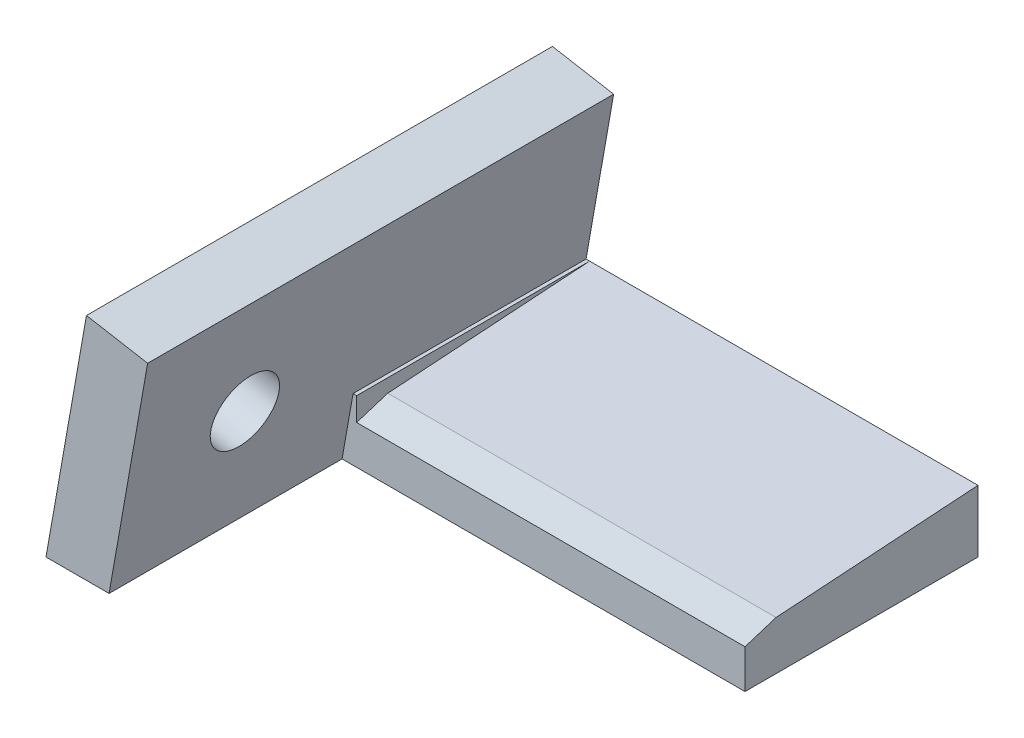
ISO-10303-21;
HEADER;
FILE_DESCRIPTION(('STEP AP214'),'2;1');
FILE_NAME('part.step','',(''),(''),'','','');
FILE_SCHEMA(('AUTOMOTIVE_DESIGN { 1 0 10303 214 1 1 1 1 }'));
ENDSEC;
DATA;
#1=APPLICATION_CONTEXT('core data for automotive mechanical design processes');
#2=APPLICATION_PROTOCOL_DEFINITION('international standard','automotive_design',2000,#1);
#3=PRODUCT_CONTEXT('',#1,'mechanical');
#4=PRODUCT('Part','Part','',(#3));
#5=PRODUCT_RELATED_PRODUCT_CATEGORY('part','',(#4));
#6=PRODUCT_DEFINITION_FORMATION('','',#4);
#7=PRODUCT_DEFINITION_CONTEXT('part definition',#1,'design');
#8=PRODUCT_DEFINITION('design','',#6,#7);
#9=PRODUCT_DEFINITION_SHAPE('','',#8);
#10=(LENGTH_UNIT() NAMED_UNIT(*) SI_UNIT(.MILLI.,.METRE.));
#11=(NAMED_UNIT(*) PLANE_ANGLE_UNIT() SI_UNIT($,.RADIAN.));
#12=(NAMED_UNIT(*) SI_UNIT($,.STERADIAN.) SOLID_ANGLE_UNIT());
#13=UNCERTAINTY_MEASURE_WITH_UNIT(LENGTH_MEASURE(1.E-05),#10,'distance_accuracy_value','');
#14=(GEOMETRIC_REPRESENTATION_CONTEXT(3) GLOBAL_UNCERTAINTY_ASSIGNED_CONTEXT((#13)) GLOBAL_UNIT_ASSIGNED_CONTEXT((#10,
#11,#12)) REPRESENTATION_CONTEXT('',''));
#15=CARTESIAN_POINT('',(0.,0.,0.));
#16=DIRECTION('',(0.,0.,1.));
#17=DIRECTION('',(1.,0.,0.));
#18=AXIS2_PLACEMENT_3D('',#15,#16,#17);
#19=CARTESIAN_POINT('',(30.,0.,15.));
#20=DIRECTION('',(0.,-1.,0.));
#21=DIRECTION('',(1.,0.,0.));
#22=AXIS2_PLACEMENT_3D('',#19,#20,#21);
#23=PLANE('',#22);
#24=DIRECTION('',(0.,0.,1.));
#25=VECTOR('',#24,1.);
#26=CARTESIAN_POINT('',(5.,0.,15.));
#27=LINE('',#26,#25);
#28=CARTESIAN_POINT('',(5.,0.,0.));
#29=VERTEX_POINT('',#28);
#30=CARTESIAN_POINT('',(5.,0.,15.));
#31=VERTEX_POINT('',#30);
#32=EDGE_CURVE('E110',#29,#31,#27,.T.);
#33=ORIENTED_EDGE('',*,*,#32,.F.);
#34=DIRECTION('',(-1.,0.,0.));
#35=VECTOR('',#34,1.);
#36=CARTESIAN_POINT('',(30.,0.,0.));
#37=LINE('',#36,#35);
#38=CARTESIAN_POINT('',(4.76701437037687,0.,0.));
#39=VERTEX_POINT('',#38);
#40=EDGE_CURVE('E172',#29,#39,#37,.T.);
#41=ORIENTED_EDGE('',*,*,#40,.T.);
#42=DIRECTION('',(0.,0.,-1.));
#43=VECTOR('',#42,1.);
#44=CARTESIAN_POINT('',(4.76701437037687,0.,15.));
#45=LINE('',#44,#43);
#46=CARTESIAN_POINT('',(4.76701437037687,0.,15.));
#47=VERTEX_POINT('',#46);
#48=EDGE_CURVE('E184',#47,#39,#45,.T.);
#49=ORIENTED_EDGE('',*,*,#48,.F.);
#50=DIRECTION('',(-1.,0.,0.));
#51=VECTOR('',#50,1.);
#52=CARTESIAN_POINT('',(30.,0.,15.));
#53=LINE('',#52,#51);
#54=EDGE_CURVE('E162',#31,#47,#53,.T.);
#55=ORIENTED_EDGE('',*,*,#54,.F.);
#56=EDGE_LOOP('',(#33,#41,#49,#55));
#57=FACE_BOUND('',#56,.T.);
#58=ADVANCED_FACE('F35',(#57),#23,.F.);
#59=CARTESIAN_POINT('',(0.,0.,15.));
#60=DIRECTION('',(0.,0.,-1.));
#61=DIRECTION('',(-1.,0.,0.));
#62=AXIS2_PLACEMENT_3D('',#59,#60,#61);
#63=PLANE('',#62);
#64=DIRECTION('',(0.,1.,0.));
#65=VECTOR('',#64,1.);
#66=CARTESIAN_POINT('',(30.,-3.99999999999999,15.));
#67=LINE('',#66,#65);
#68=CARTESIAN_POINT('',(30.,-3.99999999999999,15.));
#69=VERTEX_POINT('',#68);
#70=CARTESIAN_POINT('',(30.,-1.5,15.));
#71=VERTEX_POINT('',#70);
#72=EDGE_CURVE('E127',#69,#71,#67,.T.);
#73=ORIENTED_EDGE('',*,*,#72,.T.);
#74=DIRECTION('',(1.,0.,0.));
#75=VECTOR('',#74,1.);
#76=CARTESIAN_POINT('',(5.,-1.5,15.));
#77=LINE('',#76,#75);
#78=CARTESIAN_POINT('',(5.,-1.5,15.));
#79=VERTEX_POINT('',#78);
#80=EDGE_CURVE('E117',#79,#71,#77,.T.);
#81=ORIENTED_EDGE('',*,*,#80,.F.);
#82=DIRECTION('',(0.,-1.,0.));
#83=VECTOR('',#82,1.);
#84=CARTESIAN_POINT('',(5.,-0.999999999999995,15.));
#85=LINE('',#84,#83);
#86=EDGE_CURVE('E107',#31,#79,#85,.T.);
#87=ORIENTED_EDGE('',*,*,#86,.F.);
#88=ORIENTED_EDGE('',*,*,#54,.T.);
#89=DIRECTION('',(0.173648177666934,0.984807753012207,0.));
#90=VECTOR('',#89,1.);
#91=CARTESIAN_POINT('',(6.54395367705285,10.0775235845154,15.));
#92=LINE('',#91,#90);
#93=CARTESIAN_POINT('',(4.061706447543,-4.,15.));
#94=VERTEX_POINT('',#93);
#95=EDGE_CURVE('E58',#94,#47,#92,.T.);
#96=ORIENTED_EDGE('',*,*,#95,.F.);
#97=DIRECTION('',(1.,0.,0.));
#98=VECTOR('',#97,1.);
#99=CARTESIAN_POINT('',(0.,-4.,15.));
#100=LINE('',#99,#98);
#101=EDGE_CURVE('E158',#94,#69,#100,.T.);
#102=ORIENTED_EDGE('',*,*,#101,.T.);
#103=EDGE_LOOP('',(#73,#81,#87,#88,#96,#102));
#104=FACE_BOUND('',#103,.T.);
#105=ADVANCED_FACE('F125',(#104),#63,.F.);
#106=CARTESIAN_POINT('',(2.60472266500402,10.7721162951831,15.));
#107=DIRECTION('',(0.984807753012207,-0.173648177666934,0.));
#108=DIRECTION('',(0.173648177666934,0.984807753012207,0.));
#109=AXIS2_PLACEMENT_3D('',#106,#107,#108);
#110=PLANE('',#109);
#111=CARTESIAN_POINT('',(1.36359905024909,3.73335450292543,22.5));
#112=DIRECTION('',(0.984807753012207,-0.173648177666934,0.));
#113=DIRECTION('',(0.173648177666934,0.984807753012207,0.));
#114=AXIS2_PLACEMENT_3D('',#111,#112,#113);
#115=CIRCLE('',#114,2.2);
#116=CARTESIAN_POINT('',(1.74562504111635,5.89993155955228,22.5));
#117=VERTEX_POINT('',#116);
#118=EDGE_CURVE('E135',#117,#117,#115,.T.);
#119=ORIENTED_EDGE('',*,*,#118,.T.);
#120=EDGE_LOOP('',(#119));
#121=FACE_BOUND('',#120,.T.);
#122=DIRECTION('',(-0.173648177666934,-0.984807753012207,0.));
#123=VECTOR('',#122,1.);
#124=CARTESIAN_POINT('',(2.60472266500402,10.7721162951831,0.));
#125=LINE('',#124,#123);
#126=CARTESIAN_POINT('',(2.60472266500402,10.7721162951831,0.));
#127=VERTEX_POINT('',#126);
#128=CARTESIAN_POINT('',(0.,-4.,0.));
#129=VERTEX_POINT('',#128);
#130=EDGE_CURVE('E157',#127,#129,#125,.T.);
#131=ORIENTED_EDGE('',*,*,#130,.T.);
#132=DIRECTION('',(0.,0.,-1.));
#133=VECTOR('',#132,1.);
#134=CARTESIAN_POINT('',(0.,-4.,15.));
#135=LINE('',#134,#133);
#136=CARTESIAN_POINT('',(0.,-4.,30.));
#137=VERTEX_POINT('',#136);
#138=EDGE_CURVE('E11',#137,#129,#135,.T.);
#139=ORIENTED_EDGE('',*,*,#138,.F.);
#140=DIRECTION('',(-0.173648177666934,-0.984807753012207,0.));
#141=VECTOR('',#140,1.);
#142=CARTESIAN_POINT('',(0.,-4.,30.));
#143=LINE('',#142,#141);
#144=CARTESIAN_POINT('',(2.60472266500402,10.7721162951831,30.));
#145=VERTEX_POINT('',#144);
#146=EDGE_CURVE('E142',#145,#137,#143,.T.);
#147=ORIENTED_EDGE('',*,*,#146,.F.);
#148=DIRECTION('',(0.,0.,-1.));
#149=VECTOR('',#148,1.);
#150=CARTESIAN_POINT('',(2.60472266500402,10.7721162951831,15.));
#151=LINE('',#150,#149);
#152=EDGE_CURVE('E164',#145,#127,#151,.T.);
#153=ORIENTED_EDGE('',*,*,#152,.T.);
#154=EDGE_LOOP('',(#131,#139,#147,#153));
#155=FACE_BOUND('',#154,.T.);
#156=ADVANCED_FACE('F37',(#121,#155),#110,.F.);
#157=CARTESIAN_POINT('',(0.,-4.,15.));
#158=DIRECTION('',(0.,1.,0.));
#159=DIRECTION('',(-1.,0.,0.));
#160=AXIS2_PLACEMENT_3D('',#157,#158,#159);
#161=PLANE('',#160);
#162=DIRECTION('',(1.,0.,0.));
#163=VECTOR('',#162,1.);
#164=CARTESIAN_POINT('',(0.,-4.,0.));
#165=LINE('',#164,#163);
#166=CARTESIAN_POINT('',(30.,-3.99999999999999,0.));
#167=VERTEX_POINT('',#166);
#168=EDGE_CURVE('E167',#129,#167,#165,.T.);
#169=ORIENTED_EDGE('',*,*,#168,.T.);
#170=DIRECTION('',(0.,0.,-1.));
#171=VECTOR('',#170,1.);
#172=CARTESIAN_POINT('',(30.,-3.99999999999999,15.));
#173=LINE('',#172,#171);
#174=EDGE_CURVE('E43',#69,#167,#173,.T.);
#175=ORIENTED_EDGE('',*,*,#174,.F.);
#176=ORIENTED_EDGE('',*,*,#101,.F.);
#177=DIRECTION('',(0.,0.,-1.));
#178=VECTOR('',#177,1.);
#179=CARTESIAN_POINT('',(4.06170644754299,-4.,30.));
#180=LINE('',#179,#178);
#181=CARTESIAN_POINT('',(4.06170644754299,-4.,30.));
#182=VERTEX_POINT('',#181);
#183=EDGE_CURVE('E153',#182,#94,#180,.T.);
#184=ORIENTED_EDGE('',*,*,#183,.F.);
#185=DIRECTION('',(1.,0.,0.));
#186=VECTOR('',#185,1.);
#187=CARTESIAN_POINT('',(4.06170644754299,-4.,30.));
#188=LINE('',#187,#186);
#189=EDGE_CURVE('E145',#137,#182,#188,.T.);
#190=ORIENTED_EDGE('',*,*,#189,.F.);
#191=ORIENTED_EDGE('',*,*,#138,.T.);
#192=EDGE_LOOP('',(#169,#175,#176,#184,#190,#191));
#193=FACE_BOUND('',#192,.T.);
#194=ADVANCED_FACE('F208',(#193),#161,.F.);
#195=CARTESIAN_POINT('',(30.,-3.99999999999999,15.));
#196=DIRECTION('',(-1.,0.,0.));
#197=DIRECTION('',(0.,0.,1.));
#198=AXIS2_PLACEMENT_3D('',#195,#196,#197);
#199=PLANE('',#198);
#200=DIRECTION('',(0.,0.0665190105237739,-0.997785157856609));
#201=VECTOR('',#200,1.);
#202=CARTESIAN_POINT('',(30.,0.,0.));
#203=LINE('',#202,#201);
#204=CARTESIAN_POINT('',(30.,-0.866666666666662,13.));
#205=VERTEX_POINT('',#204);
#206=CARTESIAN_POINT('',(30.,0.,0.));
#207=VERTEX_POINT('',#206);
#208=EDGE_CURVE('E138',#205,#207,#203,.T.);
#209=ORIENTED_EDGE('',*,*,#208,.F.);
#210=DIRECTION('',(0.,0.301891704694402,-0.953342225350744));
#211=VECTOR('',#210,1.);
#212=CARTESIAN_POINT('',(30.,-0.866666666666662,13.));
#213=LINE('',#212,#211);
#214=EDGE_CURVE('E122',#71,#205,#213,.T.);
#215=ORIENTED_EDGE('',*,*,#214,.F.);
#216=ORIENTED_EDGE('',*,*,#72,.F.);
#217=ORIENTED_EDGE('',*,*,#174,.T.);
#218=DIRECTION('',(0.,1.,0.));
#219=VECTOR('',#218,1.);
#220=CARTESIAN_POINT('',(30.,-3.99999999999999,0.));
#221=LINE('',#220,#219);
#222=EDGE_CURVE('E169',#167,#207,#221,.T.);
#223=ORIENTED_EDGE('',*,*,#222,.T.);
#224=EDGE_LOOP('',(#209,#215,#216,#217,#223));
#225=FACE_BOUND('',#224,.T.);
#226=ADVANCED_FACE('F191',(#225),#199,.F.);
#227=CARTESIAN_POINT('',(4.76701437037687,0.,15.));
#228=DIRECTION('',(-0.984807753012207,0.173648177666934,0.));
#229=DIRECTION('',(-0.173648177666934,-0.984807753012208,0.));
#230=AXIS2_PLACEMENT_3D('',#227,#228,#229);
#231=PLANE('',#230);
#232=CARTESIAN_POINT('',(5.30283006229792,3.03876179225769,22.5));
#233=DIRECTION('',(0.984807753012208,-0.173648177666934,0.));
#234=DIRECTION('',(0.173648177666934,0.984807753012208,0.));
#235=AXIS2_PLACEMENT_3D('',#232,#233,#234);
#236=CIRCLE('',#235,2.2);
#237=CARTESIAN_POINT('',(5.68485605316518,5.20533884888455,22.5));
#238=VERTEX_POINT('',#237);
#239=EDGE_CURVE('E129',#238,#238,#236,.T.);
#240=ORIENTED_EDGE('',*,*,#239,.F.);
#241=EDGE_LOOP('',(#240));
#242=FACE_BOUND('',#241,.T.);
#243=DIRECTION('',(0.173648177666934,0.984807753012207,0.));
#244=VECTOR('',#243,1.);
#245=CARTESIAN_POINT('',(4.76701437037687,0.,0.));
#246=LINE('',#245,#244);
#247=CARTESIAN_POINT('',(6.54395367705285,10.0775235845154,0.));
#248=VERTEX_POINT('',#247);
#249=EDGE_CURVE('E176',#39,#248,#246,.T.);
#250=ORIENTED_EDGE('',*,*,#249,.T.);
#251=DIRECTION('',(0.,0.,-1.));
#252=VECTOR('',#251,1.);
#253=CARTESIAN_POINT('',(6.54395367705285,10.0775235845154,15.));
#254=LINE('',#253,#252);
#255=CARTESIAN_POINT('',(6.54395367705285,10.0775235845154,30.));
#256=VERTEX_POINT('',#255);
#257=EDGE_CURVE('E181',#256,#248,#254,.T.);
#258=ORIENTED_EDGE('',*,*,#257,.F.);
#259=DIRECTION('',(0.173648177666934,0.984807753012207,0.));
#260=VECTOR('',#259,1.);
#261=CARTESIAN_POINT('',(6.54395367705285,10.0775235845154,30.));
#262=LINE('',#261,#260);
#263=EDGE_CURVE('E147',#182,#256,#262,.T.);
#264=ORIENTED_EDGE('',*,*,#263,.F.);
#265=ORIENTED_EDGE('',*,*,#183,.T.);
#266=ORIENTED_EDGE('',*,*,#95,.T.);
#267=ORIENTED_EDGE('',*,*,#48,.T.);
#268=EDGE_LOOP('',(#250,#258,#264,#265,#266,#267));
#269=FACE_BOUND('',#268,.T.);
#270=ADVANCED_FACE('F204',(#242,#269),#231,.F.);
#271=CARTESIAN_POINT('',(6.54395367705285,10.0775235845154,15.));
#272=DIRECTION('',(-0.173648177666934,-0.984807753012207,0.));
#273=DIRECTION('',(0.984807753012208,-0.173648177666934,0.));
#274=AXIS2_PLACEMENT_3D('',#271,#272,#273);
#275=PLANE('',#274);
#276=DIRECTION('',(-0.984807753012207,0.173648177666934,0.));
#277=VECTOR('',#276,1.);
#278=CARTESIAN_POINT('',(6.54395367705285,10.0775235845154,0.));
#279=LINE('',#278,#277);
#280=EDGE_CURVE('E160',#248,#127,#279,.T.);
#281=ORIENTED_EDGE('',*,*,#280,.T.);
#282=ORIENTED_EDGE('',*,*,#152,.F.);
#283=DIRECTION('',(-0.984807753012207,0.173648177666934,0.));
#284=VECTOR('',#283,1.);
#285=CARTESIAN_POINT('',(2.60472266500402,10.7721162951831,30.));
#286=LINE('',#285,#284);
#287=EDGE_CURVE('E150',#256,#145,#286,.T.);
#288=ORIENTED_EDGE('',*,*,#287,.F.);
#289=ORIENTED_EDGE('',*,*,#257,.T.);
#290=EDGE_LOOP('',(#281,#282,#288,#289));
#291=FACE_BOUND('',#290,.T.);
#292=ADVANCED_FACE('F216',(#291),#275,.F.);
#293=CARTESIAN_POINT('',(0.,0.,0.));
#294=DIRECTION('',(0.,0.,-1.));
#295=DIRECTION('',(-1.,0.,0.));
#296=AXIS2_PLACEMENT_3D('',#293,#294,#295);
#297=PLANE('',#296);
#298=ORIENTED_EDGE('',*,*,#130,.F.);
#299=ORIENTED_EDGE('',*,*,#280,.F.);
#300=ORIENTED_EDGE('',*,*,#249,.F.);
#301=ORIENTED_EDGE('',*,*,#40,.F.);
#302=EDGE_CURVE('E173',#207,#29,#37,.T.);
#303=ORIENTED_EDGE('',*,*,#302,.F.);
#304=ORIENTED_EDGE('',*,*,#222,.F.);
#305=ORIENTED_EDGE('',*,*,#168,.F.);
#306=EDGE_LOOP('',(#298,#299,#300,#301,#303,#304,#305));
#307=FACE_BOUND('',#306,.T.);
#308=ADVANCED_FACE('F196',(#307),#297,.T.);
#309=CARTESIAN_POINT('',(0.,0.,30.));
#310=DIRECTION('',(0.,0.,-1.));
#311=DIRECTION('',(-1.,0.,0.));
#312=AXIS2_PLACEMENT_3D('',#309,#310,#311);
#313=PLANE('',#312);
#314=ORIENTED_EDGE('',*,*,#146,.T.);
#315=ORIENTED_EDGE('',*,*,#189,.T.);
#316=ORIENTED_EDGE('',*,*,#263,.T.);
#317=ORIENTED_EDGE('',*,*,#287,.T.);
#318=EDGE_LOOP('',(#314,#315,#316,#317));
#319=FACE_BOUND('',#318,.T.);
#320=ADVANCED_FACE('F211',(#319),#313,.F.);
#321=CARTESIAN_POINT('',(5.,0.,0.));
#322=DIRECTION('',(0.,-0.997785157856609,-0.0665190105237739));
#323=DIRECTION('',(0.,0.0665190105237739,-0.997785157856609));
#324=AXIS2_PLACEMENT_3D('',#321,#322,#323);
#325=PLANE('',#324);
#326=DIRECTION('',(0.,0.0665190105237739,-0.997785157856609));
#327=VECTOR('',#326,1.);
#328=CARTESIAN_POINT('',(5.,0.,0.));
#329=LINE('',#328,#327);
#330=CARTESIAN_POINT('',(5.,-0.866666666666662,13.));
#331=VERTEX_POINT('',#330);
#332=EDGE_CURVE('E113',#331,#29,#329,.T.);
#333=ORIENTED_EDGE('',*,*,#332,.F.);
#334=DIRECTION('',(1.,0.,0.));
#335=VECTOR('',#334,1.);
#336=CARTESIAN_POINT('',(5.,-0.866666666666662,13.));
#337=LINE('',#336,#335);
#338=EDGE_CURVE('E120',#331,#205,#337,.T.);
#339=ORIENTED_EDGE('',*,*,#338,.T.);
#340=ORIENTED_EDGE('',*,*,#208,.T.);
#341=ORIENTED_EDGE('',*,*,#302,.T.);
#342=EDGE_LOOP('',(#333,#339,#340,#341));
#343=FACE_BOUND('',#342,.T.);
#344=ADVANCED_FACE('F200',(#343),#325,.F.);
#345=CARTESIAN_POINT('',(5.,0.,0.));
#346=DIRECTION('',(1.,0.,0.));
#347=DIRECTION('',(0.,0.,-1.));
#348=AXIS2_PLACEMENT_3D('',#345,#346,#347);
#349=PLANE('',#348);
#350=ORIENTED_EDGE('',*,*,#32,.T.);
#351=ORIENTED_EDGE('',*,*,#86,.T.);
#352=DIRECTION('',(0.,0.301891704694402,-0.953342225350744));
#353=VECTOR('',#352,1.);
#354=CARTESIAN_POINT('',(5.,-0.866666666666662,13.));
#355=LINE('',#354,#353);
#356=EDGE_CURVE('E50',#79,#331,#355,.T.);
#357=ORIENTED_EDGE('',*,*,#356,.T.);
#358=ORIENTED_EDGE('',*,*,#332,.T.);
#359=EDGE_LOOP('',(#350,#351,#357,#358));
#360=FACE_BOUND('',#359,.T.);
#361=ADVANCED_FACE('F108',(#360),#349,.T.);
#362=CARTESIAN_POINT('',(0.378791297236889,3.90700268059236,22.5));
#363=DIRECTION('',(0.984807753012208,-0.173648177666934,0.));
#364=DIRECTION('',(0.173648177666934,0.984807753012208,0.));
#365=AXIS2_PLACEMENT_3D('',#362,#363,#364);
#366=CYLINDRICAL_SURFACE('',#365,2.2);
#367=ORIENTED_EDGE('',*,*,#239,.T.);
#368=EDGE_LOOP('',(#367));
#369=FACE_BOUND('',#368,.T.);
#370=ORIENTED_EDGE('',*,*,#118,.F.);
#371=EDGE_LOOP('',(#370));
#372=FACE_BOUND('',#371,.T.);
#373=ADVANCED_FACE('F243',(#369,#372),#366,.F.);
#374=CARTESIAN_POINT('',(5.,-0.866666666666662,13.));
#375=DIRECTION('',(0.,-0.953342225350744,-0.301891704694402));
#376=DIRECTION('',(0.,0.301891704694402,-0.953342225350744));
#377=AXIS2_PLACEMENT_3D('',#374,#375,#376);
#378=PLANE('',#377);
#379=ORIENTED_EDGE('',*,*,#214,.T.);
#380=ORIENTED_EDGE('',*,*,#338,.F.);
#381=ORIENTED_EDGE('',*,*,#356,.F.);
#382=ORIENTED_EDGE('',*,*,#80,.T.);
#383=EDGE_LOOP('',(#379,#380,#381,#382));
#384=FACE_BOUND('',#383,.T.);
#385=ADVANCED_FACE('F116',(#384),#378,.F.);
#386=CLOSED_SHELL('',(#58,#105,#156,#194,#226,#270,#292,#308,#320,#344,#361,#373,#385));
#387=MANIFOLD_SOLID_BREP('B2',#386);
#388=ADVANCED_BREP_SHAPE_REPRESENTATION('',(#18,#387),#14);
#389=SHAPE_DEFINITION_REPRESENTATION(#9,#388);
ENDSEC;
END-ISO-10303-21;
